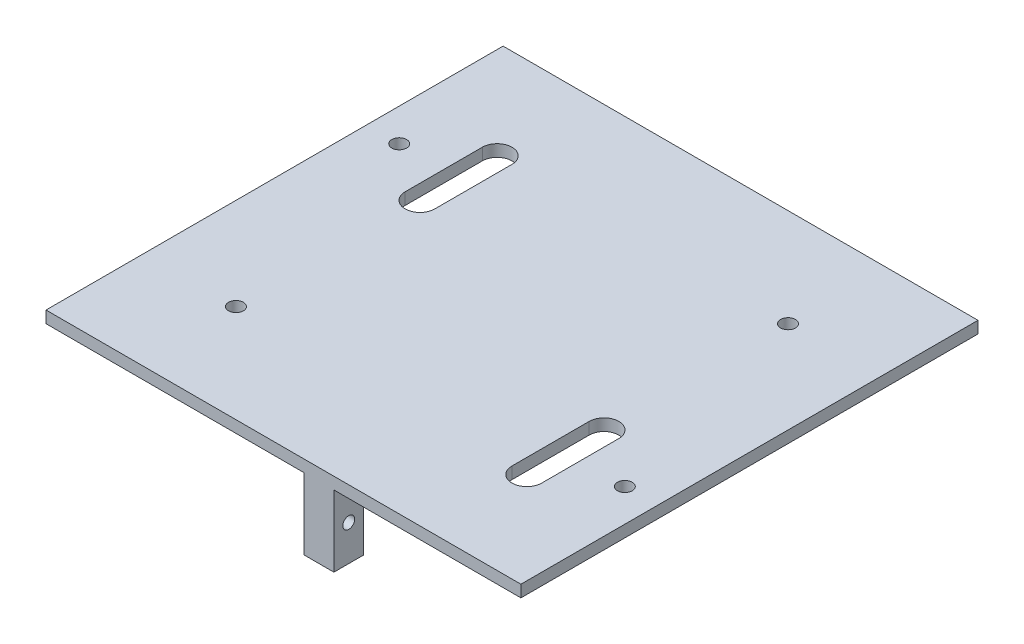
from build123d import *

# Parameters (mm, degrees)
SKICA1_W                 = 80
SKICA1_H                 = 77
P_IDAT_VYSUNUT_M1_DEPTH  = 2
ODEBRAT_VYSUNUT_M4_DEPTH = 2
SKICA1_5_W               = 5
SKICA1_5_H               = 5
P_IDAT_VYSUNUT_M2_DEPTH  = 12
ODEBRAT_VYSUNUT_M5_REACH = 65.075
SKICA2_R                 = 1
SKICA3_R                 = 1.25
ODEBRAT_VYSUNUT_M6_DEPTH = 2
SKICA4_R                 = 1.25
ODEBRAT_VYSUNUT_M7_DEPTH = 2


with BuildPart() as part:
    # Skica1 → P_idat vysunut_m1 (new body)
    with BuildSketch(Plane(origin=(0, 0, 0), x_dir=(1, 0, 0), z_dir=(0, 1, 0))):
        Rectangle(SKICA1_W, SKICA1_H)
    extrude(amount=P_IDAT_VYSUNUT_M1_DEPTH)

    # Skica1_4 → Odebrat vysunut_m4 (cut)
    with BuildSketch(Plane(origin=(0, 0, 0), x_dir=(1, 0, 0), z_dir=(0, 1, 0))):
        with BuildLine():
            Line((-27, 9), (-27, 22))
            ThreePointArc((-27, 22), (-24.5, 24.5), (-22, 22))
            Line((-22, 22), (-22, 9))
            ThreePointArc((-22, 9), (-24.5, 6.5), (-27, 9))
        make_face()
        with BuildLine():
            Line((27, -9), (27, -22))
            ThreePointArc((27, -22), (24.5, -24.5), (22, -22))
            Line((22, -22), (22, -9))
            ThreePointArc((22, -9), (24.5, -6.5), (27, -9))
        make_face()
    extrude(amount=ODEBRAT_VYSUNUT_M4_DEPTH, mode=Mode.SUBTRACT)

    # Skica1_5 → P_idat vysunut_m2 (add)
    with BuildSketch(Plane(origin=(0, 0, 0), x_dir=(1, 0, 0), z_dir=(0, 1, 0))):
        with Locations((-6, 36)):
            Rectangle(SKICA1_5_W, SKICA1_5_H)
        with Locations((-6, 7.5)):
            Rectangle(SKICA1_5_W, SKICA1_5_H)
        with Locations((6, -36)):
            Rectangle(SKICA1_5_W, SKICA1_5_H)
        with Locations((6, -7.5)):
            Rectangle(SKICA1_5_W, SKICA1_5_H)
    extrude(amount=-P_IDAT_VYSUNUT_M2_DEPTH)

    # Odebrat vysunut_m5: up to this face of the body (flat: up to its plane)
    odebrat_vysunut_m5_end = Plane(part.part.faces().sort_by_distance((8.5, -6, 36))[0])
    # Skica2 → Odebrat vysunut_m5 (cut, up to the picked face)
    with BuildSketch(Plane.ZY.offset(8.5), mode=Mode.PRIVATE) as odebrat_vysunut_m5_sk1:
        with Locations((-7.5, -6)):
            Circle(SKICA2_R)
    odebrat_vysunut_m5_tool1 = split(extrude(odebrat_vysunut_m5_sk1.sketch, amount=-ODEBRAT_VYSUNUT_M5_REACH, mode=Mode.PRIVATE), bisect_by=odebrat_vysunut_m5_end, keep=Keep.BOTH, mode=Mode.PRIVATE)
    # Skica2 → Odebrat vysunut_m5 (cut, up to the picked face)
    with BuildSketch(Plane.ZY.offset(8.5), mode=Mode.PRIVATE) as odebrat_vysunut_m5_sk2:
        with Locations((7.5, -6)):
            Circle(SKICA2_R)
    odebrat_vysunut_m5_tool2 = split(extrude(odebrat_vysunut_m5_sk2.sketch, amount=-ODEBRAT_VYSUNUT_M5_REACH, mode=Mode.PRIVATE), bisect_by=odebrat_vysunut_m5_end, keep=Keep.BOTH, mode=Mode.PRIVATE)
    # Skica2 → Odebrat vysunut_m5 (cut, up to the picked face)
    with BuildSketch(Plane.ZY.offset(8.5), mode=Mode.PRIVATE) as odebrat_vysunut_m5_sk3:
        with Locations((-36, -6)):
            Circle(SKICA2_R)
    odebrat_vysunut_m5_tool3 = split(extrude(odebrat_vysunut_m5_sk3.sketch, amount=-ODEBRAT_VYSUNUT_M5_REACH, mode=Mode.PRIVATE), bisect_by=odebrat_vysunut_m5_end, keep=Keep.BOTH, mode=Mode.PRIVATE)
    # Skica2 → Odebrat vysunut_m5 (cut, up to the picked face)
    with BuildSketch(Plane.ZY.offset(8.5), mode=Mode.PRIVATE) as odebrat_vysunut_m5_sk4:
        with Locations((36, -6)):
            Circle(SKICA2_R)
    odebrat_vysunut_m5_tool4 = split(extrude(odebrat_vysunut_m5_sk4.sketch, amount=-ODEBRAT_VYSUNUT_M5_REACH, mode=Mode.PRIVATE), bisect_by=odebrat_vysunut_m5_end, keep=Keep.BOTH, mode=Mode.PRIVATE)
    add(odebrat_vysunut_m5_tool1.solids().sort_by(Axis((-8.5, -6, -7.5), (1, 0, 0)))[0], mode=Mode.SUBTRACT)
    add(odebrat_vysunut_m5_tool2.solids().sort_by(Axis((-8.5, -6, 7.5), (1, 0, 0)))[0], mode=Mode.SUBTRACT)
    add(odebrat_vysunut_m5_tool3.solids().sort_by(Axis((-8.5, -6, -36), (1, 0, 0)))[0], mode=Mode.SUBTRACT)
    add(odebrat_vysunut_m5_tool4.solids().sort_by(Axis((-8.5, -6, 36), (1, 0, 0)))[0], mode=Mode.SUBTRACT)

    # Skica3 → Odebrat vysunut_m6 (cut)
    with BuildSketch(Plane.XZ):
        with Locations(Location((-34.5, -15.5, 0), (0, 0, 270))):
            Circle(SKICA3_R)
        with Locations(Location((34.5, 15.5, 0), (0, 0, 270))):
            Circle(SKICA3_R)
    extrude(amount=-ODEBRAT_VYSUNUT_M6_DEPTH, mode=Mode.SUBTRACT)

    # Skica4 → Odebrat vysunut_m7 (cut)
    with BuildSketch(Plane.XZ):
        with Locations(Location((24.5, -22, 0), (0, 0, 270))):
            Circle(SKICA4_R)
        with Locations(Location((-24.5, 22, 0), (0, 0, 270))):
            Circle(SKICA4_R)
    extrude(amount=-ODEBRAT_VYSUNUT_M7_DEPTH, mode=Mode.SUBTRACT)


solid = part.part
